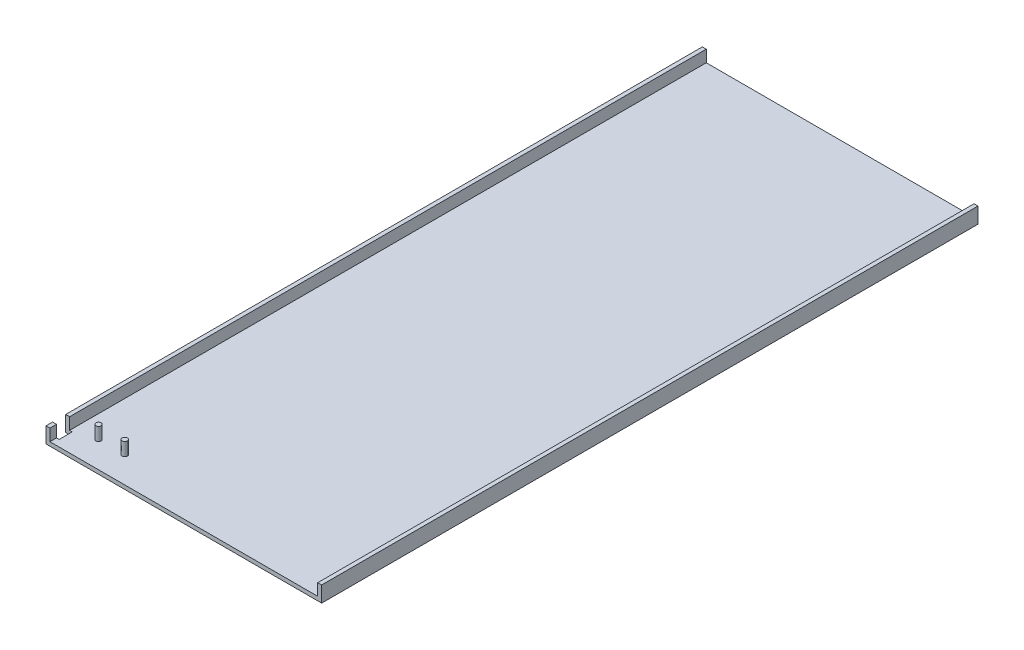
ISO-10303-21;
HEADER;
FILE_DESCRIPTION(('STEP AP214'),'2;1');
FILE_NAME('part.step','',(''),(''),'','','');
FILE_SCHEMA(('AUTOMOTIVE_DESIGN { 1 0 10303 214 1 1 1 1 }'));
ENDSEC;
DATA;
#1=APPLICATION_CONTEXT('core data for automotive mechanical design processes');
#2=APPLICATION_PROTOCOL_DEFINITION('international standard','automotive_design',2000,#1);
#3=PRODUCT_CONTEXT('',#1,'mechanical');
#4=PRODUCT('Part','Part','',(#3));
#5=PRODUCT_RELATED_PRODUCT_CATEGORY('part','',(#4));
#6=PRODUCT_DEFINITION_FORMATION('','',#4);
#7=PRODUCT_DEFINITION_CONTEXT('part definition',#1,'design');
#8=PRODUCT_DEFINITION('design','',#6,#7);
#9=PRODUCT_DEFINITION_SHAPE('','',#8);
#10=(LENGTH_UNIT() NAMED_UNIT(*) SI_UNIT(.MILLI.,.METRE.));
#11=(NAMED_UNIT(*) PLANE_ANGLE_UNIT() SI_UNIT($,.RADIAN.));
#12=(NAMED_UNIT(*) SI_UNIT($,.STERADIAN.) SOLID_ANGLE_UNIT());
#13=UNCERTAINTY_MEASURE_WITH_UNIT(LENGTH_MEASURE(1.E-05),#10,'distance_accuracy_value','');
#14=(GEOMETRIC_REPRESENTATION_CONTEXT(3) GLOBAL_UNCERTAINTY_ASSIGNED_CONTEXT((#13)) GLOBAL_UNIT_ASSIGNED_CONTEXT((#10,
#11,#12)) REPRESENTATION_CONTEXT('',''));
#15=CARTESIAN_POINT('',(0.,0.,0.));
#16=DIRECTION('',(0.,0.,1.));
#17=DIRECTION('',(1.,0.,0.));
#18=AXIS2_PLACEMENT_3D('',#15,#16,#17);
#19=CARTESIAN_POINT('',(3.,12.,500.));
#20=DIRECTION('',(1.,0.,0.));
#21=DIRECTION('',(0.,1.,0.));
#22=AXIS2_PLACEMENT_3D('',#19,#20,#21);
#23=PLANE('',#22);
#24=DIRECTION('',(0.,-1.,0.));
#25=VECTOR('',#24,1.);
#26=CARTESIAN_POINT('',(3.,12.,495.));
#27=LINE('',#26,#25);
#28=CARTESIAN_POINT('',(3.,12.,495.));
#29=VERTEX_POINT('',#28);
#30=CARTESIAN_POINT('',(3.,3.,495.));
#31=VERTEX_POINT('',#30);
#32=EDGE_CURVE('E218',#29,#31,#27,.T.);
#33=ORIENTED_EDGE('',*,*,#32,.F.);
#34=DIRECTION('',(0.,0.,-1.));
#35=VECTOR('',#34,1.);
#36=CARTESIAN_POINT('',(3.,12.,500.));
#37=LINE('',#36,#35);
#38=CARTESIAN_POINT('',(3.,12.,500.));
#39=VERTEX_POINT('',#38);
#40=EDGE_CURVE('E169',#39,#29,#37,.T.);
#41=ORIENTED_EDGE('',*,*,#40,.F.);
#42=DIRECTION('',(0.,-1.,0.));
#43=VECTOR('',#42,1.);
#44=CARTESIAN_POINT('',(3.,12.,500.));
#45=LINE('',#44,#43);
#46=CARTESIAN_POINT('',(3.,3.,500.));
#47=VERTEX_POINT('',#46);
#48=EDGE_CURVE('E135',#39,#47,#45,.T.);
#49=ORIENTED_EDGE('',*,*,#48,.T.);
#50=DIRECTION('',(0.,0.,-1.));
#51=VECTOR('',#50,1.);
#52=CARTESIAN_POINT('',(3.,3.,500.));
#53=LINE('',#52,#51);
#54=EDGE_CURVE('E172',#47,#31,#53,.T.);
#55=ORIENTED_EDGE('',*,*,#54,.T.);
#56=EDGE_LOOP('',(#33,#41,#49,#55));
#57=FACE_BOUND('',#56,.T.);
#58=ADVANCED_FACE('F30',(#57),#23,.T.);
#59=CARTESIAN_POINT('',(0.,12.,500.));
#60=DIRECTION('',(0.,1.,0.));
#61=DIRECTION('',(0.,0.,1.));
#62=AXIS2_PLACEMENT_3D('',#59,#60,#61);
#63=PLANE('',#62);
#64=DIRECTION('',(-1.,0.,0.));
#65=VECTOR('',#64,1.);
#66=CARTESIAN_POINT('',(5.,12.,495.));
#67=LINE('',#66,#65);
#68=CARTESIAN_POINT('',(0.,12.,495.));
#69=VERTEX_POINT('',#68);
#70=EDGE_CURVE('E119',#29,#69,#67,.T.);
#71=ORIENTED_EDGE('',*,*,#70,.T.);
#72=DIRECTION('',(0.,0.,-1.));
#73=VECTOR('',#72,1.);
#74=CARTESIAN_POINT('',(0.,12.,500.));
#75=LINE('',#74,#73);
#76=CARTESIAN_POINT('',(0.,12.,500.));
#77=VERTEX_POINT('',#76);
#78=EDGE_CURVE('E111',#77,#69,#75,.T.);
#79=ORIENTED_EDGE('',*,*,#78,.F.);
#80=DIRECTION('',(1.,0.,0.));
#81=VECTOR('',#80,1.);
#82=CARTESIAN_POINT('',(0.,12.,500.));
#83=LINE('',#82,#81);
#84=EDGE_CURVE('E116',#77,#39,#83,.T.);
#85=ORIENTED_EDGE('',*,*,#84,.T.);
#86=ORIENTED_EDGE('',*,*,#40,.T.);
#87=EDGE_LOOP('',(#71,#79,#85,#86));
#88=FACE_BOUND('',#87,.T.);
#89=ADVANCED_FACE('F113',(#88),#63,.T.);
#90=CARTESIAN_POINT('',(0.,12.,500.));
#91=DIRECTION('',(1.,0.,0.));
#92=DIRECTION('',(0.,1.,0.));
#93=AXIS2_PLACEMENT_3D('',#90,#91,#92);
#94=PLANE('',#93);
#95=ORIENTED_EDGE('',*,*,#78,.T.);
#96=DIRECTION('',(0.,1.,0.));
#97=VECTOR('',#96,1.);
#98=CARTESIAN_POINT('',(0.,12.,495.));
#99=LINE('',#98,#97);
#100=CARTESIAN_POINT('',(0.,0.,495.));
#101=VERTEX_POINT('',#100);
#102=EDGE_CURVE('E242',#101,#69,#99,.T.);
#103=ORIENTED_EDGE('',*,*,#102,.F.);
#104=DIRECTION('',(0.,0.,-1.));
#105=VECTOR('',#104,1.);
#106=CARTESIAN_POINT('',(0.,0.,500.));
#107=LINE('',#106,#105);
#108=CARTESIAN_POINT('',(0.,0.,500.));
#109=VERTEX_POINT('',#108);
#110=EDGE_CURVE('E129',#109,#101,#107,.T.);
#111=ORIENTED_EDGE('',*,*,#110,.F.);
#112=DIRECTION('',(0.,-1.,0.));
#113=VECTOR('',#112,1.);
#114=CARTESIAN_POINT('',(0.,12.,500.));
#115=LINE('',#114,#113);
#116=EDGE_CURVE('E126',#77,#109,#115,.T.);
#117=ORIENTED_EDGE('',*,*,#116,.F.);
#118=EDGE_LOOP('',(#95,#103,#111,#117));
#119=FACE_BOUND('',#118,.T.);
#120=ADVANCED_FACE('F127',(#119),#94,.F.);
#121=CARTESIAN_POINT('',(0.,3.,500.));
#122=DIRECTION('',(0.,1.,0.));
#123=DIRECTION('',(0.,0.,1.));
#124=AXIS2_PLACEMENT_3D('',#121,#122,#123);
#125=PLANE('',#124);
#126=DIRECTION('',(1.,0.,0.));
#127=VECTOR('',#126,1.);
#128=CARTESIAN_POINT('',(0.,3.,495.));
#129=LINE('',#128,#127);
#130=CARTESIAN_POINT('',(5.,3.,495.));
#131=VERTEX_POINT('',#130);
#132=EDGE_CURVE('E213',#31,#131,#129,.T.);
#133=ORIENTED_EDGE('',*,*,#132,.F.);
#134=ORIENTED_EDGE('',*,*,#54,.F.);
#135=DIRECTION('',(1.,0.,0.));
#136=VECTOR('',#135,1.);
#137=CARTESIAN_POINT('',(0.,3.,500.));
#138=LINE('',#137,#136);
#139=CARTESIAN_POINT('',(207.,3.,500.));
#140=VERTEX_POINT('',#139);
#141=EDGE_CURVE('E137',#47,#140,#138,.T.);
#142=ORIENTED_EDGE('',*,*,#141,.T.);
#143=DIRECTION('',(0.,0.,-1.));
#144=VECTOR('',#143,1.);
#145=CARTESIAN_POINT('',(207.,3.,500.));
#146=LINE('',#145,#144);
#147=CARTESIAN_POINT('',(207.,3.,0.));
#148=VERTEX_POINT('',#147);
#149=EDGE_CURVE('E175',#140,#148,#146,.T.);
#150=ORIENTED_EDGE('',*,*,#149,.T.);
#151=DIRECTION('',(1.,0.,0.));
#152=VECTOR('',#151,1.);
#153=CARTESIAN_POINT('',(0.,3.,0.));
#154=LINE('',#153,#152);
#155=CARTESIAN_POINT('',(3.,3.,0.));
#156=VERTEX_POINT('',#155);
#157=EDGE_CURVE('E153',#156,#148,#154,.T.);
#158=ORIENTED_EDGE('',*,*,#157,.F.);
#159=CARTESIAN_POINT('',(3.,3.,485.));
#160=VERTEX_POINT('',#159);
#161=EDGE_CURVE('E171',#160,#156,#53,.T.);
#162=ORIENTED_EDGE('',*,*,#161,.F.);
#163=DIRECTION('',(-1.,0.,0.));
#164=VECTOR('',#163,1.);
#165=CARTESIAN_POINT('',(0.,3.,485.));
#166=LINE('',#165,#164);
#167=CARTESIAN_POINT('',(5.,3.,485.));
#168=VERTEX_POINT('',#167);
#169=EDGE_CURVE('E221',#168,#160,#166,.T.);
#170=ORIENTED_EDGE('',*,*,#169,.F.);
#171=DIRECTION('',(0.,0.,-1.));
#172=VECTOR('',#171,1.);
#173=CARTESIAN_POINT('',(5.,3.,500.));
#174=LINE('',#173,#172);
#175=EDGE_CURVE('E227',#131,#168,#174,.T.);
#176=ORIENTED_EDGE('',*,*,#175,.F.);
#177=EDGE_LOOP('',(#133,#134,#142,#150,#158,#162,#170,#176));
#178=FACE_BOUND('',#177,.T.);
#179=CARTESIAN_POINT('',(20.,3.,480.));
#180=DIRECTION('',(0.,1.,0.));
#181=DIRECTION('',(0.,0.,1.));
#182=AXIS2_PLACEMENT_3D('',#179,#180,#181);
#183=CIRCLE('',#182,2.);
#184=CARTESIAN_POINT('',(20.,3.,482.));
#185=VERTEX_POINT('',#184);
#186=EDGE_CURVE('E204',#185,#185,#183,.T.);
#187=ORIENTED_EDGE('',*,*,#186,.F.);
#188=EDGE_LOOP('',(#187));
#189=FACE_BOUND('',#188,.T.);
#190=CARTESIAN_POINT('',(40.,3.,480.));
#191=DIRECTION('',(0.,1.,0.));
#192=DIRECTION('',(0.,0.,1.));
#193=AXIS2_PLACEMENT_3D('',#190,#191,#192);
#194=CIRCLE('',#193,2.);
#195=CARTESIAN_POINT('',(40.,3.,482.));
#196=VERTEX_POINT('',#195);
#197=EDGE_CURVE('E210',#196,#196,#194,.T.);
#198=ORIENTED_EDGE('',*,*,#197,.F.);
#199=EDGE_LOOP('',(#198));
#200=FACE_BOUND('',#199,.T.);
#201=ADVANCED_FACE('F194',(#178,#189,#200),#125,.T.);
#202=CARTESIAN_POINT('',(210.,0.,500.));
#203=DIRECTION('',(-1.,0.,0.));
#204=DIRECTION('',(0.,0.,1.));
#205=AXIS2_PLACEMENT_3D('',#202,#203,#204);
#206=PLANE('',#205);
#207=DIRECTION('',(0.,1.,0.));
#208=VECTOR('',#207,1.);
#209=CARTESIAN_POINT('',(210.,0.,0.));
#210=LINE('',#209,#208);
#211=CARTESIAN_POINT('',(210.,0.,0.));
#212=VERTEX_POINT('',#211);
#213=CARTESIAN_POINT('',(210.,12.,0.));
#214=VERTEX_POINT('',#213);
#215=EDGE_CURVE('E143',#212,#214,#210,.T.);
#216=ORIENTED_EDGE('',*,*,#215,.T.);
#217=DIRECTION('',(0.,0.,-1.));
#218=VECTOR('',#217,1.);
#219=CARTESIAN_POINT('',(210.,12.,500.));
#220=LINE('',#219,#218);
#221=CARTESIAN_POINT('',(210.,12.,500.));
#222=VERTEX_POINT('',#221);
#223=EDGE_CURVE('E11',#222,#214,#220,.T.);
#224=ORIENTED_EDGE('',*,*,#223,.F.);
#225=DIRECTION('',(0.,1.,0.));
#226=VECTOR('',#225,1.);
#227=CARTESIAN_POINT('',(210.,0.,500.));
#228=LINE('',#227,#226);
#229=CARTESIAN_POINT('',(210.,0.,500.));
#230=VERTEX_POINT('',#229);
#231=EDGE_CURVE('E91',#230,#222,#228,.T.);
#232=ORIENTED_EDGE('',*,*,#231,.F.);
#233=DIRECTION('',(0.,0.,-1.));
#234=VECTOR('',#233,1.);
#235=CARTESIAN_POINT('',(210.,0.,500.));
#236=LINE('',#235,#234);
#237=EDGE_CURVE('E142',#230,#212,#236,.T.);
#238=ORIENTED_EDGE('',*,*,#237,.T.);
#239=EDGE_LOOP('',(#216,#224,#232,#238));
#240=FACE_BOUND('',#239,.T.);
#241=ADVANCED_FACE('F32',(#240),#206,.F.);
#242=CARTESIAN_POINT('',(207.,12.,500.));
#243=DIRECTION('',(0.,1.,0.));
#244=DIRECTION('',(0.,0.,1.));
#245=AXIS2_PLACEMENT_3D('',#242,#243,#244);
#246=PLANE('',#245);
#247=DIRECTION('',(1.,0.,0.));
#248=VECTOR('',#247,1.);
#249=CARTESIAN_POINT('',(207.,12.,0.));
#250=LINE('',#249,#248);
#251=CARTESIAN_POINT('',(207.,12.,0.));
#252=VERTEX_POINT('',#251);
#253=EDGE_CURVE('E146',#252,#214,#250,.T.);
#254=ORIENTED_EDGE('',*,*,#253,.F.);
#255=DIRECTION('',(0.,0.,-1.));
#256=VECTOR('',#255,1.);
#257=CARTESIAN_POINT('',(207.,12.,500.));
#258=LINE('',#257,#256);
#259=CARTESIAN_POINT('',(207.,12.,500.));
#260=VERTEX_POINT('',#259);
#261=EDGE_CURVE('E38',#260,#252,#258,.T.);
#262=ORIENTED_EDGE('',*,*,#261,.F.);
#263=DIRECTION('',(1.,0.,0.));
#264=VECTOR('',#263,1.);
#265=CARTESIAN_POINT('',(207.,12.,500.));
#266=LINE('',#265,#264);
#267=EDGE_CURVE('E199',#260,#222,#266,.T.);
#268=ORIENTED_EDGE('',*,*,#267,.T.);
#269=ORIENTED_EDGE('',*,*,#223,.T.);
#270=EDGE_LOOP('',(#254,#262,#268,#269));
#271=FACE_BOUND('',#270,.T.);
#272=ADVANCED_FACE('F185',(#271),#246,.T.);
#273=CARTESIAN_POINT('',(207.,0.,500.));
#274=DIRECTION('',(-1.,0.,0.));
#275=DIRECTION('',(0.,0.,1.));
#276=AXIS2_PLACEMENT_3D('',#273,#274,#275);
#277=PLANE('',#276);
#278=DIRECTION('',(0.,1.,0.));
#279=VECTOR('',#278,1.);
#280=CARTESIAN_POINT('',(207.,0.,0.));
#281=LINE('',#280,#279);
#282=EDGE_CURVE('E150',#148,#252,#281,.T.);
#283=ORIENTED_EDGE('',*,*,#282,.F.);
#284=ORIENTED_EDGE('',*,*,#149,.F.);
#285=DIRECTION('',(0.,1.,0.));
#286=VECTOR('',#285,1.);
#287=CARTESIAN_POINT('',(207.,0.,500.));
#288=LINE('',#287,#286);
#289=EDGE_CURVE('E182',#140,#260,#288,.T.);
#290=ORIENTED_EDGE('',*,*,#289,.T.);
#291=ORIENTED_EDGE('',*,*,#261,.T.);
#292=EDGE_LOOP('',(#283,#284,#290,#291));
#293=FACE_BOUND('',#292,.T.);
#294=ADVANCED_FACE('F180',(#293),#277,.T.);
#295=DIRECTION('',(0.,1.,0.));
#296=VECTOR('',#295,1.);
#297=CARTESIAN_POINT('',(3.,12.,485.));
#298=LINE('',#297,#296);
#299=CARTESIAN_POINT('',(3.,12.,485.));
#300=VERTEX_POINT('',#299);
#301=EDGE_CURVE('E224',#160,#300,#298,.T.);
#302=ORIENTED_EDGE('',*,*,#301,.F.);
#303=ORIENTED_EDGE('',*,*,#161,.T.);
#304=DIRECTION('',(0.,-1.,0.));
#305=VECTOR('',#304,1.);
#306=CARTESIAN_POINT('',(3.,12.,0.));
#307=LINE('',#306,#305);
#308=CARTESIAN_POINT('',(3.,12.,0.));
#309=VERTEX_POINT('',#308);
#310=EDGE_CURVE('E156',#309,#156,#307,.T.);
#311=ORIENTED_EDGE('',*,*,#310,.F.);
#312=EDGE_CURVE('E122',#300,#309,#37,.T.);
#313=ORIENTED_EDGE('',*,*,#312,.F.);
#314=EDGE_LOOP('',(#302,#303,#311,#313));
#315=FACE_BOUND('',#314,.T.);
#316=ADVANCED_FACE('F270',(#315),#23,.T.);
#317=DIRECTION('',(-1.,0.,0.));
#318=VECTOR('',#317,1.);
#319=CARTESIAN_POINT('',(5.,12.,485.));
#320=LINE('',#319,#318);
#321=CARTESIAN_POINT('',(0.,12.,485.));
#322=VERTEX_POINT('',#321);
#323=EDGE_CURVE('E232',#300,#322,#320,.T.);
#324=ORIENTED_EDGE('',*,*,#323,.F.);
#325=ORIENTED_EDGE('',*,*,#312,.T.);
#326=DIRECTION('',(1.,0.,0.));
#327=VECTOR('',#326,1.);
#328=CARTESIAN_POINT('',(0.,12.,0.));
#329=LINE('',#328,#327);
#330=CARTESIAN_POINT('',(0.,12.,0.));
#331=VERTEX_POINT('',#330);
#332=EDGE_CURVE('E159',#331,#309,#329,.T.);
#333=ORIENTED_EDGE('',*,*,#332,.F.);
#334=EDGE_CURVE('E123',#322,#331,#75,.T.);
#335=ORIENTED_EDGE('',*,*,#334,.F.);
#336=EDGE_LOOP('',(#324,#325,#333,#335));
#337=FACE_BOUND('',#336,.T.);
#338=ADVANCED_FACE('F274',(#337),#63,.T.);
#339=CARTESIAN_POINT('',(0.,0.,485.));
#340=VERTEX_POINT('',#339);
#341=CARTESIAN_POINT('',(0.,0.,0.));
#342=VERTEX_POINT('',#341);
#343=EDGE_CURVE('E167',#340,#342,#107,.T.);
#344=ORIENTED_EDGE('',*,*,#343,.F.);
#345=DIRECTION('',(0.,-1.,0.));
#346=VECTOR('',#345,1.);
#347=CARTESIAN_POINT('',(0.,12.,485.));
#348=LINE('',#347,#346);
#349=EDGE_CURVE('E239',#322,#340,#348,.T.);
#350=ORIENTED_EDGE('',*,*,#349,.F.);
#351=ORIENTED_EDGE('',*,*,#334,.T.);
#352=DIRECTION('',(0.,-1.,0.));
#353=VECTOR('',#352,1.);
#354=CARTESIAN_POINT('',(0.,12.,0.));
#355=LINE('',#354,#353);
#356=EDGE_CURVE('E162',#331,#342,#355,.T.);
#357=ORIENTED_EDGE('',*,*,#356,.T.);
#358=EDGE_LOOP('',(#344,#350,#351,#357));
#359=FACE_BOUND('',#358,.T.);
#360=ADVANCED_FACE('F282',(#359),#94,.F.);
#361=CARTESIAN_POINT('',(0.,0.,500.));
#362=DIRECTION('',(0.,1.,0.));
#363=DIRECTION('',(0.,0.,1.));
#364=AXIS2_PLACEMENT_3D('',#361,#362,#363);
#365=PLANE('',#364);
#366=ORIENTED_EDGE('',*,*,#110,.T.);
#367=DIRECTION('',(-1.,0.,0.));
#368=VECTOR('',#367,1.);
#369=CARTESIAN_POINT('',(5.,0.,495.));
#370=LINE('',#369,#368);
#371=CARTESIAN_POINT('',(5.,0.,495.));
#372=VERTEX_POINT('',#371);
#373=EDGE_CURVE('E230',#372,#101,#370,.T.);
#374=ORIENTED_EDGE('',*,*,#373,.F.);
#375=DIRECTION('',(0.,0.,1.));
#376=VECTOR('',#375,1.);
#377=CARTESIAN_POINT('',(5.,0.,495.));
#378=LINE('',#377,#376);
#379=CARTESIAN_POINT('',(5.,0.,485.));
#380=VERTEX_POINT('',#379);
#381=EDGE_CURVE('E233',#380,#372,#378,.T.);
#382=ORIENTED_EDGE('',*,*,#381,.F.);
#383=DIRECTION('',(-1.,0.,0.));
#384=VECTOR('',#383,1.);
#385=CARTESIAN_POINT('',(5.,0.,485.));
#386=LINE('',#385,#384);
#387=EDGE_CURVE('E45',#380,#340,#386,.T.);
#388=ORIENTED_EDGE('',*,*,#387,.T.);
#389=ORIENTED_EDGE('',*,*,#343,.T.);
#390=DIRECTION('',(1.,0.,0.));
#391=VECTOR('',#390,1.);
#392=CARTESIAN_POINT('',(0.,0.,0.));
#393=LINE('',#392,#391);
#394=EDGE_CURVE('E85',#342,#212,#393,.T.);
#395=ORIENTED_EDGE('',*,*,#394,.T.);
#396=ORIENTED_EDGE('',*,*,#237,.F.);
#397=DIRECTION('',(1.,0.,0.));
#398=VECTOR('',#397,1.);
#399=CARTESIAN_POINT('',(0.,0.,500.));
#400=LINE('',#399,#398);
#401=EDGE_CURVE('E54',#109,#230,#400,.T.);
#402=ORIENTED_EDGE('',*,*,#401,.F.);
#403=EDGE_LOOP('',(#366,#374,#382,#388,#389,#395,#396,#402));
#404=FACE_BOUND('',#403,.T.);
#405=ADVANCED_FACE('F286',(#404),#365,.F.);
#406=CARTESIAN_POINT('',(210.,12.,500.));
#407=DIRECTION('',(0.,0.,-1.));
#408=DIRECTION('',(-1.,0.,0.));
#409=AXIS2_PLACEMENT_3D('',#406,#407,#408);
#410=PLANE('',#409);
#411=ORIENTED_EDGE('',*,*,#231,.T.);
#412=ORIENTED_EDGE('',*,*,#267,.F.);
#413=ORIENTED_EDGE('',*,*,#289,.F.);
#414=ORIENTED_EDGE('',*,*,#141,.F.);
#415=ORIENTED_EDGE('',*,*,#48,.F.);
#416=ORIENTED_EDGE('',*,*,#84,.F.);
#417=ORIENTED_EDGE('',*,*,#116,.T.);
#418=ORIENTED_EDGE('',*,*,#401,.T.);
#419=EDGE_LOOP('',(#411,#412,#413,#414,#415,#416,#417,#418));
#420=FACE_BOUND('',#419,.T.);
#421=ADVANCED_FACE('F132',(#420),#410,.F.);
#422=CARTESIAN_POINT('',(210.,12.,0.));
#423=DIRECTION('',(0.,0.,-1.));
#424=DIRECTION('',(-1.,0.,0.));
#425=AXIS2_PLACEMENT_3D('',#422,#423,#424);
#426=PLANE('',#425);
#427=ORIENTED_EDGE('',*,*,#215,.F.);
#428=ORIENTED_EDGE('',*,*,#394,.F.);
#429=ORIENTED_EDGE('',*,*,#356,.F.);
#430=ORIENTED_EDGE('',*,*,#332,.T.);
#431=ORIENTED_EDGE('',*,*,#310,.T.);
#432=ORIENTED_EDGE('',*,*,#157,.T.);
#433=ORIENTED_EDGE('',*,*,#282,.T.);
#434=ORIENTED_EDGE('',*,*,#253,.T.);
#435=EDGE_LOOP('',(#427,#428,#429,#430,#431,#432,#433,#434));
#436=FACE_BOUND('',#435,.T.);
#437=ADVANCED_FACE('F188',(#436),#426,.T.);
#438=CARTESIAN_POINT('',(20.,13.,480.));
#439=DIRECTION('',(0.,-1.,0.));
#440=DIRECTION('',(0.,0.,-1.));
#441=AXIS2_PLACEMENT_3D('',#438,#439,#440);
#442=CYLINDRICAL_SURFACE('',#441,2.);
#443=CARTESIAN_POINT('',(20.,13.,480.));
#444=DIRECTION('',(0.,1.,0.));
#445=DIRECTION('',(0.,0.,1.));
#446=AXIS2_PLACEMENT_3D('',#443,#444,#445);
#447=CIRCLE('',#446,2.);
#448=CARTESIAN_POINT('',(20.,13.,482.));
#449=VERTEX_POINT('',#448);
#450=EDGE_CURVE('E147',#449,#449,#447,.T.);
#451=ORIENTED_EDGE('',*,*,#450,.F.);
#452=EDGE_LOOP('',(#451));
#453=FACE_BOUND('',#452,.T.);
#454=ORIENTED_EDGE('',*,*,#186,.T.);
#455=EDGE_LOOP('',(#454));
#456=FACE_BOUND('',#455,.T.);
#457=ADVANCED_FACE('F330',(#453,#456),#442,.T.);
#458=CARTESIAN_POINT('',(20.,13.,480.));
#459=DIRECTION('',(0.,1.,0.));
#460=DIRECTION('',(0.,0.,1.));
#461=AXIS2_PLACEMENT_3D('',#458,#459,#460);
#462=PLANE('',#461);
#463=ORIENTED_EDGE('',*,*,#450,.T.);
#464=EDGE_LOOP('',(#463));
#465=FACE_BOUND('',#464,.T.);
#466=ADVANCED_FACE('F334',(#465),#462,.T.);
#467=CARTESIAN_POINT('',(40.,13.,480.));
#468=DIRECTION('',(0.,-1.,0.));
#469=DIRECTION('',(0.,0.,-1.));
#470=AXIS2_PLACEMENT_3D('',#467,#468,#469);
#471=CYLINDRICAL_SURFACE('',#470,2.);
#472=CARTESIAN_POINT('',(40.,13.,480.));
#473=DIRECTION('',(0.,1.,0.));
#474=DIRECTION('',(0.,0.,1.));
#475=AXIS2_PLACEMENT_3D('',#472,#473,#474);
#476=CIRCLE('',#475,2.);
#477=CARTESIAN_POINT('',(40.,13.,482.));
#478=VERTEX_POINT('',#477);
#479=EDGE_CURVE('E207',#478,#478,#476,.T.);
#480=ORIENTED_EDGE('',*,*,#479,.F.);
#481=EDGE_LOOP('',(#480));
#482=FACE_BOUND('',#481,.T.);
#483=ORIENTED_EDGE('',*,*,#197,.T.);
#484=EDGE_LOOP('',(#483));
#485=FACE_BOUND('',#484,.T.);
#486=ADVANCED_FACE('F338',(#482,#485),#471,.T.);
#487=CARTESIAN_POINT('',(40.,13.,480.));
#488=DIRECTION('',(0.,1.,0.));
#489=DIRECTION('',(0.,0.,1.));
#490=AXIS2_PLACEMENT_3D('',#487,#488,#489);
#491=PLANE('',#490);
#492=ORIENTED_EDGE('',*,*,#479,.T.);
#493=EDGE_LOOP('',(#492));
#494=FACE_BOUND('',#493,.T.);
#495=ADVANCED_FACE('F342',(#494),#491,.T.);
#496=CARTESIAN_POINT('',(5.,12.,495.));
#497=DIRECTION('',(0.,0.,1.));
#498=DIRECTION('',(1.,0.,0.));
#499=AXIS2_PLACEMENT_3D('',#496,#497,#498);
#500=PLANE('',#499);
#501=ORIENTED_EDGE('',*,*,#132,.T.);
#502=DIRECTION('',(0.,1.,0.));
#503=VECTOR('',#502,1.);
#504=CARTESIAN_POINT('',(5.,12.,495.));
#505=LINE('',#504,#503);
#506=EDGE_CURVE('E241',#372,#131,#505,.T.);
#507=ORIENTED_EDGE('',*,*,#506,.F.);
#508=ORIENTED_EDGE('',*,*,#373,.T.);
#509=ORIENTED_EDGE('',*,*,#102,.T.);
#510=ORIENTED_EDGE('',*,*,#70,.F.);
#511=ORIENTED_EDGE('',*,*,#32,.T.);
#512=EDGE_LOOP('',(#501,#507,#508,#509,#510,#511));
#513=FACE_BOUND('',#512,.T.);
#514=ADVANCED_FACE('F288',(#513),#500,.F.);
#515=CARTESIAN_POINT('',(5.,12.,485.));
#516=DIRECTION('',(0.,0.,-1.));
#517=DIRECTION('',(-1.,0.,0.));
#518=AXIS2_PLACEMENT_3D('',#515,#516,#517);
#519=PLANE('',#518);
#520=ORIENTED_EDGE('',*,*,#169,.T.);
#521=ORIENTED_EDGE('',*,*,#301,.T.);
#522=ORIENTED_EDGE('',*,*,#323,.T.);
#523=ORIENTED_EDGE('',*,*,#349,.T.);
#524=ORIENTED_EDGE('',*,*,#387,.F.);
#525=DIRECTION('',(0.,-1.,0.));
#526=VECTOR('',#525,1.);
#527=CARTESIAN_POINT('',(5.,12.,485.));
#528=LINE('',#527,#526);
#529=EDGE_CURVE('E247',#168,#380,#528,.T.);
#530=ORIENTED_EDGE('',*,*,#529,.F.);
#531=EDGE_LOOP('',(#520,#521,#522,#523,#524,#530));
#532=FACE_BOUND('',#531,.T.);
#533=ADVANCED_FACE('F264',(#532),#519,.F.);
#534=CARTESIAN_POINT('',(5.,0.,495.));
#535=DIRECTION('',(1.,0.,0.));
#536=DIRECTION('',(0.,1.,0.));
#537=AXIS2_PLACEMENT_3D('',#534,#535,#536);
#538=PLANE('',#537);
#539=ORIENTED_EDGE('',*,*,#175,.T.);
#540=ORIENTED_EDGE('',*,*,#529,.T.);
#541=ORIENTED_EDGE('',*,*,#381,.T.);
#542=ORIENTED_EDGE('',*,*,#506,.T.);
#543=EDGE_LOOP('',(#539,#540,#541,#542));
#544=FACE_BOUND('',#543,.T.);
#545=ADVANCED_FACE('F254',(#544),#538,.F.);
#546=CLOSED_SHELL('',(#58,#89,#120,#201,#241,#272,#294,#316,#338,#360,#405,#421,#437,#457,#466,
#486,#495,#514,#533,#545));
#547=MANIFOLD_SOLID_BREP('B2',#546);
#548=ADVANCED_BREP_SHAPE_REPRESENTATION('',(#18,#547),#14);
#549=SHAPE_DEFINITION_REPRESENTATION(#9,#548);
ENDSEC;
END-ISO-10303-21;
